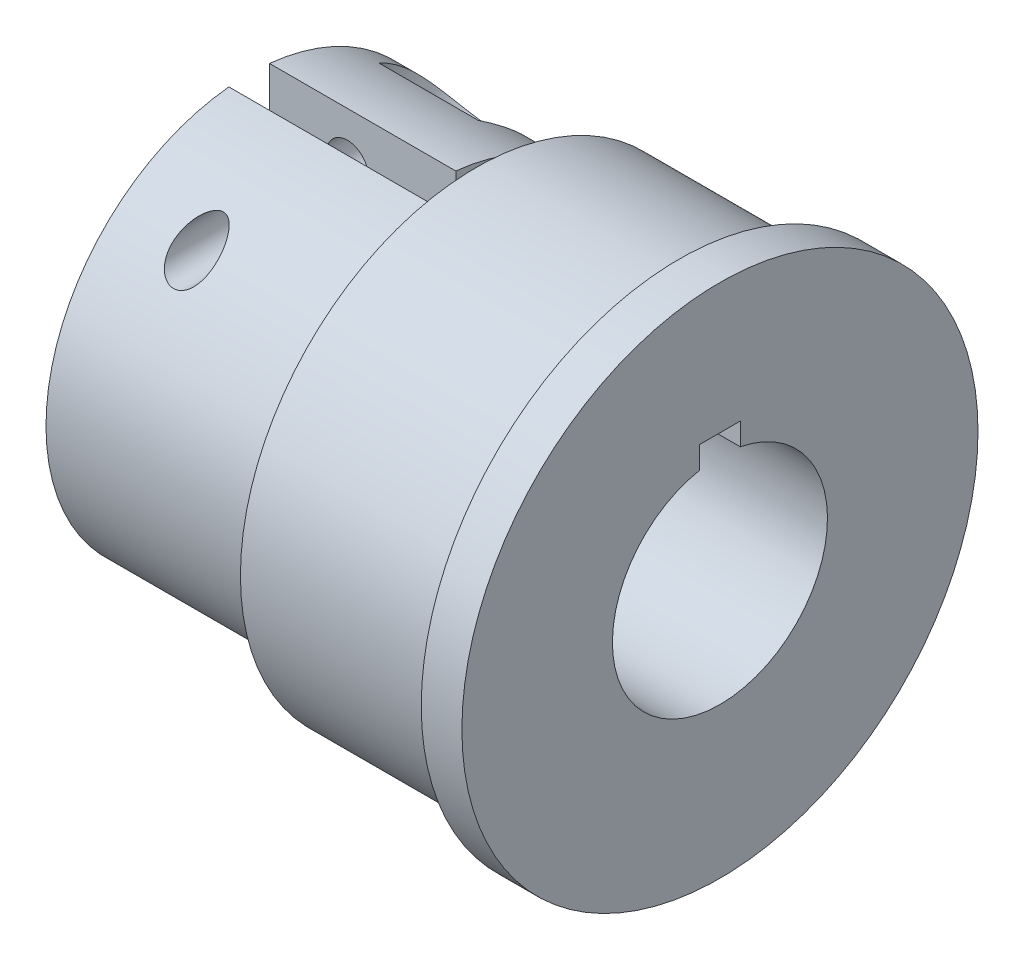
ISO-10303-21;
HEADER;
FILE_DESCRIPTION(('STEP AP214'),'2;1');
FILE_NAME('part.step','',(''),(''),'','','');
FILE_SCHEMA(('AUTOMOTIVE_DESIGN { 1 0 10303 214 1 1 1 1 }'));
ENDSEC;
DATA;
#1=APPLICATION_CONTEXT('core data for automotive mechanical design processes');
#2=APPLICATION_PROTOCOL_DEFINITION('international standard','automotive_design',2000,#1);
#3=PRODUCT_CONTEXT('',#1,'mechanical');
#4=PRODUCT('Part','Part','',(#3));
#5=PRODUCT_RELATED_PRODUCT_CATEGORY('part','',(#4));
#6=PRODUCT_DEFINITION_FORMATION('','',#4);
#7=PRODUCT_DEFINITION_CONTEXT('part definition',#1,'design');
#8=PRODUCT_DEFINITION('design','',#6,#7);
#9=PRODUCT_DEFINITION_SHAPE('','',#8);
#10=(LENGTH_UNIT() NAMED_UNIT(*) SI_UNIT(.MILLI.,.METRE.));
#11=(NAMED_UNIT(*) PLANE_ANGLE_UNIT() SI_UNIT($,.RADIAN.));
#12=(NAMED_UNIT(*) SI_UNIT($,.STERADIAN.) SOLID_ANGLE_UNIT());
#13=UNCERTAINTY_MEASURE_WITH_UNIT(LENGTH_MEASURE(1.E-05),#10,'distance_accuracy_value','');
#14=(GEOMETRIC_REPRESENTATION_CONTEXT(3) GLOBAL_UNCERTAINTY_ASSIGNED_CONTEXT((#13)) GLOBAL_UNIT_ASSIGNED_CONTEXT((#10,
#11,#12)) REPRESENTATION_CONTEXT('',''));
#15=CARTESIAN_POINT('',(0.,0.,0.));
#16=DIRECTION('',(0.,0.,1.));
#17=DIRECTION('',(1.,0.,0.));
#18=AXIS2_PLACEMENT_3D('',#15,#16,#17);
#19=CARTESIAN_POINT('',(-30.,0.,0.));
#20=DIRECTION('',(1.,0.,0.));
#21=DIRECTION('',(0.,0.,-1.));
#22=AXIS2_PLACEMENT_3D('',#19,#20,#21);
#23=CYLINDRICAL_SURFACE('',#22,15.);
#24=CARTESIAN_POINT('',(-9.32416043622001,14.9916643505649,0.5));
#25=CARTESIAN_POINT('',(-9.33032237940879,14.9945038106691,0.414885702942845));
#26=CARTESIAN_POINT('',(-9.33494133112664,14.9966202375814,0.329641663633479));
#27=CARTESIAN_POINT('',(-9.34102292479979,14.9993996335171,0.159021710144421));
#28=CARTESIAN_POINT('',(-9.3424857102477,15.0000626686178,0.0736458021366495));
#29=CARTESIAN_POINT('',(-9.34203562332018,14.9998611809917,-0.18212944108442));
#30=CARTESIAN_POINT('',(-9.33531162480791,14.9968184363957,-0.352546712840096));
#31=CARTESIAN_POINT('',(-9.30986999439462,14.9850609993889,-0.690002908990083));
#32=CARTESIAN_POINT('',(-9.29130961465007,14.9764206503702,-0.857056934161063));
#33=CARTESIAN_POINT('',(-9.24401949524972,14.9536991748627,-1.18938565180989));
#34=CARTESIAN_POINT('',(-9.21528489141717,14.9396154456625,-1.35465945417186));
#35=CARTESIAN_POINT('',(-9.11564784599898,14.8887770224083,-1.85417969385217));
#36=CARTESIAN_POINT('',(-9.03200866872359,14.8436919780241,-2.1850160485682));
#37=CARTESIAN_POINT('',(-8.84738202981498,14.7327541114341,-2.83831325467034));
#38=CARTESIAN_POINT('',(-8.74637190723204,14.6668740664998,-3.16076252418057));
#39=CARTESIAN_POINT('',(-8.53683209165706,14.5139829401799,-3.8018226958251));
#40=CARTESIAN_POINT('',(-8.42823774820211,14.4267687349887,-4.12036379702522));
#41=CARTESIAN_POINT('',(-8.21189338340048,14.2315291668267,-4.75104879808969));
#42=CARTESIAN_POINT('',(-8.10414287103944,14.1235170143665,-5.06319662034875));
#43=CARTESIAN_POINT('',(-7.89872166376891,13.8905254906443,-5.67056150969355));
#44=CARTESIAN_POINT('',(-7.80082879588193,13.7662859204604,-5.96598594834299));
#45=CARTESIAN_POINT('',(-7.6154025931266,13.4976710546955,-6.55106841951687));
#46=CARTESIAN_POINT('',(-7.52787257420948,13.3532893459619,-6.8407245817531));
#47=CARTESIAN_POINT('',(-7.36817513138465,13.0448412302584,-7.41194900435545));
#48=CARTESIAN_POINT('',(-7.29593802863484,12.8808696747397,-7.69354866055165));
#49=CARTESIAN_POINT('',(-7.1714195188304,12.5327294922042,-8.24850194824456));
#50=CARTESIAN_POINT('',(-7.11912415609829,12.3485751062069,-8.52186122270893));
#51=CARTESIAN_POINT('',(-7.05705175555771,12.0424677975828,-8.94514790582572));
#52=CARTESIAN_POINT('',(-7.03864406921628,11.927009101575,-9.09854213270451));
#53=CARTESIAN_POINT('',(-7.01186626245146,11.6898417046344,-9.4013053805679));
#54=CARTESIAN_POINT('',(-7.00349342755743,11.5681347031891,-9.55067547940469));
#55=CARTESIAN_POINT('',(-6.99826662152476,11.3189585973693,-9.84470954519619));
#56=CARTESIAN_POINT('',(-7.00140994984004,11.1914908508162,-9.98937460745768));
#57=CARTESIAN_POINT('',(-7.02084281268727,10.9315206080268,-10.2732107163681));
#58=CARTESIAN_POINT('',(-7.03712956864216,10.7990191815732,-10.4123829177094));
#59=CARTESIAN_POINT('',(-7.07972274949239,10.5576398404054,-10.6564243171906));
#60=CARTESIAN_POINT('',(-7.10329459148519,10.4494803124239,-10.7624822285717));
#61=CARTESIAN_POINT('',(-7.16074119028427,10.2314636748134,-10.9699487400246));
#62=CARTESIAN_POINT('',(-7.19461341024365,10.1216069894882,-11.0713584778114));
#63=CARTESIAN_POINT('',(-7.27349650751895,9.90127287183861,-11.2688358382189));
#64=CARTESIAN_POINT('',(-7.3184964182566,9.79079615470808,-11.3649086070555));
#65=CARTESIAN_POINT('',(-7.42044511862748,9.57036567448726,-11.5511428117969));
#66=CARTESIAN_POINT('',(-7.47739113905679,9.46041179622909,-11.6413056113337));
#67=CARTESIAN_POINT('',(-7.59067218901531,9.26526624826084,-11.7969071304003));
#68=CARTESIAN_POINT('',(-7.64465836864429,9.17969221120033,-11.8635808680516));
#69=CARTESIAN_POINT('',(-7.76072217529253,9.01069204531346,-11.9924439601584));
#70=CARTESIAN_POINT('',(-7.82279806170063,8.92726545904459,-12.0546342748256));
#71=CARTESIAN_POINT('',(-7.95515745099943,8.7634904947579,-12.1742153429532));
#72=CARTESIAN_POINT('',(-8.02544244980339,8.68314268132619,-12.2316052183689));
#73=CARTESIAN_POINT('',(-8.17412351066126,8.52661408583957,-12.3412308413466));
#74=CARTESIAN_POINT('',(-8.2525155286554,8.45043125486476,-12.3934691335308));
#75=CARTESIAN_POINT('',(-8.4178592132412,8.30269698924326,-12.4929266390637));
#76=CARTESIAN_POINT('',(-8.50487265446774,8.231186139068,-12.5401037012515));
#77=CARTESIAN_POINT('',(-8.68648345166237,8.09459668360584,-12.6287026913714));
#78=CARTESIAN_POINT('',(-8.7810771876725,8.02951504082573,-12.670127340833));
#79=CARTESIAN_POINT('',(-8.97726210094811,7.90683283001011,-12.7470482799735));
#80=CARTESIAN_POINT('',(-9.07885251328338,7.84923144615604,-12.7825452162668));
#81=CARTESIAN_POINT('',(-9.28823614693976,7.74251029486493,-12.8474682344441));
#82=CARTESIAN_POINT('',(-9.39602848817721,7.69338932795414,-12.8768951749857));
#83=CARTESIAN_POINT('',(-9.60323810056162,7.60998528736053,-12.9263365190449));
#84=CARTESIAN_POINT('',(-9.70205161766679,7.57461983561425,-12.9470638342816));
#85=CARTESIAN_POINT('',(-9.90296217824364,7.51158236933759,-12.9837383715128));
#86=CARTESIAN_POINT('',(-10.0050588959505,7.48390959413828,-12.9996860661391));
#87=CARTESIAN_POINT('',(-10.211695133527,7.43666116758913,-13.026772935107));
#88=CARTESIAN_POINT('',(-10.3162337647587,7.41708261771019,-13.0379138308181));
#89=CARTESIAN_POINT('',(-10.5269330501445,7.38629146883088,-13.0553825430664));
#90=CARTESIAN_POINT('',(-10.6330936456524,7.37507856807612,-13.0617105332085));
#91=CARTESIAN_POINT('',(-10.8387220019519,7.36166397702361,-13.069275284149));
#92=CARTESIAN_POINT('',(-10.9381410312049,7.3588891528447,-13.0708358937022));
#93=CARTESIAN_POINT('',(-11.1369217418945,7.36075377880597,-13.0697859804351));
#94=CARTESIAN_POINT('',(-11.2362833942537,7.36539563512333,-13.0671741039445));
#95=CARTESIAN_POINT('',(-11.4341342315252,7.38203586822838,-13.0577807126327));
#96=CARTESIAN_POINT('',(-11.532623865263,7.39403020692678,-13.0510014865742));
#97=CARTESIAN_POINT('',(-11.7281104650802,7.42522582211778,-13.0332782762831));
#98=CARTESIAN_POINT('',(-11.8251068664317,7.44442975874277,-13.0223327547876));
#99=CARTESIAN_POINT('',(-12.0157232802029,7.48953212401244,-12.9964447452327));
#100=CARTESIAN_POINT('',(-12.1093700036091,7.51534633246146,-12.9815524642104));
#101=CARTESIAN_POINT('',(-12.2938938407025,7.57345802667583,-12.9477356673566));
#102=CARTESIAN_POINT('',(-12.3847699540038,7.60575782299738,-12.9288097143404));
#103=CARTESIAN_POINT('',(-12.6522809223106,7.71181650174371,-12.8660276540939));
#104=CARTESIAN_POINT('',(-12.823988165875,7.79478037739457,-12.8161418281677));
#105=CARTESIAN_POINT('',(-13.1549998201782,7.98421554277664,-12.6990163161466));
#106=CARTESIAN_POINT('',(-13.3137521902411,8.09133785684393,-12.6312850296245));
#107=CARTESIAN_POINT('',(-13.6099102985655,8.32259426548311,-12.4801233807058));
#108=CARTESIAN_POINT('',(-13.7473111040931,8.44673227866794,-12.3966894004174));
#109=CARTESIAN_POINT('',(-14.0100107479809,8.71796715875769,-12.2076448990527));
#110=CARTESIAN_POINT('',(-14.1332871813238,8.8661186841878,-12.1007519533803));
#111=CARTESIAN_POINT('',(-14.3529805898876,9.17040256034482,-11.871813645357));
#112=CARTESIAN_POINT('',(-14.4493824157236,9.32653935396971,-11.7497597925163));
#113=CARTESIAN_POINT('',(-14.5940709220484,9.59906501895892,-11.5273627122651));
#114=CARTESIAN_POINT('',(-14.6483230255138,9.71482662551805,-11.4300323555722));
#115=CARTESIAN_POINT('',(-14.744085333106,9.94631132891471,-11.2291744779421));
#116=CARTESIAN_POINT('',(-14.7855909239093,10.0620343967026,-11.1256447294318));
#117=CARTESIAN_POINT('',(-14.8568465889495,10.2922724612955,-10.9130075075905));
#118=CARTESIAN_POINT('',(-14.8865781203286,10.4067852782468,-10.803891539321));
#119=CARTESIAN_POINT('',(-14.935235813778,10.6334501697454,-10.5808809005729));
#120=CARTESIAN_POINT('',(-14.9541587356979,10.7456015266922,-10.4669848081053));
#121=CARTESIAN_POINT('',(-14.9883320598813,11.0149392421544,-10.1844970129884));
#122=CARTESIAN_POINT('',(-14.9983942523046,11.1704679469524,-10.0136867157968));
#123=CARTESIAN_POINT('',(-15.0012513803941,11.4735249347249,-9.66497143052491));
#124=CARTESIAN_POINT('',(-14.9940386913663,11.6210496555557,-9.48706334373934));
#125=CARTESIAN_POINT('',(-14.9649465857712,11.9072858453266,-9.12522906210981));
#126=CARTESIAN_POINT('',(-14.9430534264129,12.0459889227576,-8.94129738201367));
#127=CARTESIAN_POINT('',(-14.8869140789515,12.3139141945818,-8.56856041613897));
#128=CARTESIAN_POINT('',(-14.8526683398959,12.4431367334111,-8.37975530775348));
#129=CARTESIAN_POINT('',(-14.750997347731,12.7641306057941,-7.88711693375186));
#130=CARTESIAN_POINT('',(-14.6758518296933,12.9486620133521,-7.58013824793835));
#131=CARTESIAN_POINT('',(-14.5067460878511,13.293452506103,-6.95779233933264));
#132=CARTESIAN_POINT('',(-14.4127737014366,13.4536957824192,-6.64241980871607));
#133=CARTESIAN_POINT('',(-14.2116559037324,13.7507853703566,-6.00337819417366));
#134=CARTESIAN_POINT('',(-14.1044602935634,13.8875374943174,-5.67968143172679));
#135=CARTESIAN_POINT('',(-13.8831013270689,14.1373263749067,-5.02578469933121));
#136=CARTESIAN_POINT('',(-13.7689405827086,14.2503719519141,-4.6955871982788));
#137=CARTESIAN_POINT('',(-13.5677767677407,14.4288504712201,-4.10834482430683));
#138=CARTESIAN_POINT('',(-13.4808305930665,14.4991992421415,-3.85275985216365));
#139=CARTESIAN_POINT('',(-13.3105696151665,14.6265323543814,-3.33693826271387));
#140=CARTESIAN_POINT('',(-13.2272561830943,14.6835116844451,-3.07669994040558));
#141=CARTESIAN_POINT('',(-13.0702424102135,14.783482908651,-2.55324096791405));
#142=CARTESIAN_POINT('',(-12.9964634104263,14.8265943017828,-2.29006719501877));
#143=CARTESIAN_POINT('',(-12.8650136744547,14.8990503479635,-1.75790149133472));
#144=CARTESIAN_POINT('',(-12.8073260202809,14.9284094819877,-1.4889159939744));
#145=CARTESIAN_POINT('',(-12.7389529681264,14.9619675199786,-1.07675585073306));
#146=CARTESIAN_POINT('',(-12.7190218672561,14.9714702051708,-0.93554273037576));
#147=CARTESIAN_POINT('',(-12.6870899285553,14.9864946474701,-0.652015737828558));
#148=CARTESIAN_POINT('',(-12.6750874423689,14.9920172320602,-0.509702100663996));
#149=CARTESIAN_POINT('',(-12.6597924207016,14.9990392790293,-0.222781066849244));
#150=CARTESIAN_POINT('',(-12.6566064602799,15.0004895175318,-0.0781666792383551));
#151=CARTESIAN_POINT('',(-12.6593491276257,14.9992159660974,0.211099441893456));
#152=CARTESIAN_POINT('',(-12.6652867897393,14.9964880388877,0.355751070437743));
#153=CARTESIAN_POINT('',(-12.67583956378,14.9916643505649,0.5));
#154=B_SPLINE_CURVE_WITH_KNOTS('',3,(#24,#25,#26,#27,#28,#29,#30,#31,#32,#33,#34,#35,#36,#37,
#38,#39,#40,#41,#42,#43,#44,#45,#46,#47,#48,#49,#50,#51,#52,#53,#54,#55,#56,#57,#58,#59,#60,#61,
#62,#63,#64,#65,#66,#67,#68,#69,#70,#71,#72,#73,#74,#75,#76,#77,#78,#79,#80,#81,#82,#83,#84,#85,
#86,#87,#88,#89,#90,#91,#92,#93,#94,#95,#96,#97,#98,#99,#100,#101,#102,#103,#104,#105,#106,#107,
#108,#109,#110,#111,#112,#113,#114,#115,#116,#117,#118,#119,#120,#121,#122,#123,#124,#125,#126,
#127,#128,#129,#130,#131,#132,#133,#134,#135,#136,#137,#138,#139,#140,#141,#142,#143,#144,#145,
#146,#147,#148,#149,#150,#151,#152,#153),.UNSPECIFIED.,.F.,.F.,(4,2,2,2,2,2,2,2,2,2,2,2,2,2,2,2,
2,2,2,2,2,2,2,2,2,2,2,2,2,2,2,2,2,2,2,2,2,2,2,2,2,2,2,2,2,2,2,2,2,2,2,2,2,2,2,2,2,2,2,2,2,2,2,2,
4),(0.,0.256122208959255,0.512232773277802,1.02334248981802,1.52779943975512,2.03249789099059,
3.06318192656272,4.0952208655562,5.137496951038,6.17911317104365,7.18369526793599,
8.18859795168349,9.18881848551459,10.1883377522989,10.7666148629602,11.3447355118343,
11.9227205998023,12.5005835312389,12.9601195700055,13.4195425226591,13.8785144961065,
14.3373801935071,14.7005591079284,15.0636600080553,15.4268271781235,15.7898140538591,
16.1556212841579,16.5212548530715,16.8868485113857,17.2523904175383,17.5729083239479,
17.8933945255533,18.2137658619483,18.5341256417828,18.8321767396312,19.1303245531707,
19.4283087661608,19.7264030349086,20.0208734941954,20.3154490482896,20.9040167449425,
21.5108949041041,22.117913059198,22.7765451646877,23.4355477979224,23.9169629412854,
24.3985521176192,24.8808967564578,25.3633859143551,26.055996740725,26.7489133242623,
27.4424794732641,28.1360204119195,29.2321940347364,30.3290781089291,31.4302623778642,
32.5310362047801,33.3676610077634,34.2045989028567,35.0341187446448,35.862763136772,
36.2913157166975,36.7197791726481,37.1533997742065,37.5874500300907),.UNSPECIFIED.);
#155=CARTESIAN_POINT('',(-7.34750753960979,12.9903810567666,-7.5));
#156=VERTEX_POINT('',#155);
#157=CARTESIAN_POINT('',(-14.6524924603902,12.9903810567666,-7.5));
#158=VERTEX_POINT('',#157);
#159=EDGE_CURVE('E43',#156,#158,#154,.T.);
#160=ORIENTED_EDGE('',*,*,#159,.F.);
#161=DIRECTION('',(1.,0.,0.));
#162=VECTOR('',#161,1.);
#163=CARTESIAN_POINT('',(-30.,12.9903810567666,-7.5));
#164=LINE('',#163,#162);
#165=EDGE_CURVE('E195',#158,#156,#164,.T.);
#166=ORIENTED_EDGE('',*,*,#165,.F.);
#167=EDGE_LOOP('',(#160,#166));
#168=FACE_BOUND('',#167,.T.);
#169=CARTESIAN_POINT('',(-9.46653771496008,11.3596453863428,9.79583874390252));
#170=CARTESIAN_POINT('',(-9.46654209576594,11.3020112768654,9.86267479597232));
#171=CARTESIAN_POINT('',(-9.46978458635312,11.2437937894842,9.92898814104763));
#172=CARTESIAN_POINT('',(-9.48320493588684,11.1265650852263,10.0601850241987));
#173=CARTESIAN_POINT('',(-9.49338418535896,11.0675537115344,10.1250682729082));
#174=CARTESIAN_POINT('',(-9.53512190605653,10.8902193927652,10.3166394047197));
#175=CARTESIAN_POINT('',(-9.57787302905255,10.77120429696,10.4407025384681));
#176=CARTESIAN_POINT('',(-9.67477232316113,10.5840034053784,10.6296347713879));
#177=CARTESIAN_POINT('',(-9.71787547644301,10.514188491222,10.6986370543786));
#178=CARTESIAN_POINT('',(-9.81833215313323,10.3786977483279,10.8301182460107));
#179=CARTESIAN_POINT('',(-9.87566701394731,10.3130166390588,10.8926055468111));
#180=CARTESIAN_POINT('',(-9.99273885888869,10.2011348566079,10.9973429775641));
#181=CARTESIAN_POINT('',(-10.0498194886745,10.1536349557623,11.0411619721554));
#182=CARTESIAN_POINT('',(-10.1737320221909,10.065604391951,11.1214723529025));
#183=CARTESIAN_POINT('',(-10.2405527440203,10.0250658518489,11.1579720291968));
#184=CARTESIAN_POINT('',(-10.3709309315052,9.95958921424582,11.2164245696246));
#185=CARTESIAN_POINT('',(-10.4331040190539,9.93316986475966,11.2397964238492));
#186=CARTESIAN_POINT('',(-10.5624749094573,9.88833474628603,11.2792611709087));
#187=CARTESIAN_POINT('',(-10.629670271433,9.86991511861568,11.2953575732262));
#188=CARTESIAN_POINT('',(-10.767696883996,9.8422407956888,11.31948068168));
#189=CARTESIAN_POINT('',(-10.8385438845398,9.83303003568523,11.3274687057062));
#190=CARTESIAN_POINT('',(-10.9812728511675,9.82463366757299,11.3347522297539));
#191=CARTESIAN_POINT('',(-11.0531545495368,9.82544551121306,11.3340499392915));
#192=CARTESIAN_POINT('',(-11.1896470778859,9.83654148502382,11.3244202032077));
#193=CARTESIAN_POINT('',(-11.2543723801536,9.84604683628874,11.3161689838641));
#194=CARTESIAN_POINT('',(-11.3808856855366,9.87283171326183,11.2928077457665));
#195=CARTESIAN_POINT('',(-11.4426736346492,9.89011138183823,11.2776976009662));
#196=CARTESIAN_POINT('',(-11.5638739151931,9.93213045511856,11.2407110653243));
#197=CARTESIAN_POINT('',(-11.6231475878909,9.95709024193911,11.2186342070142));
#198=CARTESIAN_POINT('',(-11.7361985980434,10.0129816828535,11.1687780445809));
#199=CARTESIAN_POINT('',(-11.7899730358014,10.0439164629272,11.1409957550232));
#200=CARTESIAN_POINT('',(-11.9130749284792,10.1246269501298,11.0677907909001));
#201=CARTESIAN_POINT('',(-11.9793392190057,10.176832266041,11.0198812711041));
#202=CARTESIAN_POINT('',(-12.0995272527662,10.2876102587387,10.9165403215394));
#203=CARTESIAN_POINT('',(-12.1534262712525,10.3461953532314,10.8610941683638));
#204=CARTESIAN_POINT('',(-12.2668341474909,10.4891765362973,10.7233483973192));
#205=CARTESIAN_POINT('',(-12.3212811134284,10.5752242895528,10.6386054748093));
#206=CARTESIAN_POINT('',(-12.4104932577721,10.7499950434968,10.461987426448));
#207=CARTESIAN_POINT('',(-12.44522902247,10.8387218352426,10.3701018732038));
#208=CARTESIAN_POINT('',(-12.507476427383,11.0505978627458,10.1447734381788));
#209=CARTESIAN_POINT('',(-12.5269352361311,11.1737249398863,10.009057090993));
#210=CARTESIAN_POINT('',(-12.5346462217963,11.3548171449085,9.80187183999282));
#211=CARTESIAN_POINT('',(-12.5336211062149,11.414659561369,9.73211199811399));
#212=CARTESIAN_POINT('',(-12.5248007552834,11.5328461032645,9.59175883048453));
#213=CARTESIAN_POINT('',(-12.5170080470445,11.5911907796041,9.52116582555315));
#214=CARTESIAN_POINT('',(-12.4946682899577,11.7076122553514,9.37766439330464));
#215=CARTESIAN_POINT('',(-12.4799471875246,11.7656406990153,9.30474430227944));
#216=CARTESIAN_POINT('',(-12.4438796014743,11.8795351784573,9.15888637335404));
#217=CARTESIAN_POINT('',(-12.4225350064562,11.9354018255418,9.08594854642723));
#218=CARTESIAN_POINT('',(-12.373261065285,12.0446627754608,8.94060136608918));
#219=CARTESIAN_POINT('',(-12.345340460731,12.0980602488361,8.86819144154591));
#220=CARTESIAN_POINT('',(-12.2827217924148,12.2021527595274,8.72441063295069));
#221=CARTESIAN_POINT('',(-12.2480267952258,12.2528490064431,8.65303929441));
#222=CARTESIAN_POINT('',(-12.1645295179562,12.3600433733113,8.49938804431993));
#223=CARTESIAN_POINT('',(-12.1143125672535,12.4159472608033,8.41745228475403));
#224=CARTESIAN_POINT('',(-12.0025189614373,12.522589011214,8.25796101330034));
#225=CARTESIAN_POINT('',(-11.9409489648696,12.5733298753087,8.18040296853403));
#226=CARTESIAN_POINT('',(-11.8227125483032,12.6551496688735,8.0530303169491));
#227=CARTESIAN_POINT('',(-11.7691835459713,12.6878456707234,8.00136550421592));
#228=CARTESIAN_POINT('',(-11.6538223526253,12.7482595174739,7.9047513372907));
#229=CARTESIAN_POINT('',(-11.5920081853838,12.775987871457,7.85978784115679));
#230=CARTESIAN_POINT('',(-11.4820488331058,12.8161093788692,7.79411883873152));
#231=CARTESIAN_POINT('',(-11.4364666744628,12.8305029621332,7.77037798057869));
#232=CARTESIAN_POINT('',(-11.3415500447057,12.8553879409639,7.72913841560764));
#233=CARTESIAN_POINT('',(-11.2922216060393,12.8658854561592,7.71162992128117));
#234=CARTESIAN_POINT('',(-11.198068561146,12.8808958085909,7.68652771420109));
#235=CARTESIAN_POINT('',(-11.1536391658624,12.8860590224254,7.67785903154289));
#236=CARTESIAN_POINT('',(-11.0637111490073,12.8924449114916,7.66713151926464));
#237=CARTESIAN_POINT('',(-11.0182132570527,12.8936702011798,7.66506830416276));
#238=CARTESIAN_POINT('',(-10.9274877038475,12.8920644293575,7.66776866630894));
#239=CARTESIAN_POINT('',(-10.8822601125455,12.8892323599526,7.67253393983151));
#240=CARTESIAN_POINT('',(-10.7933406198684,12.8797783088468,7.68839341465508));
#241=CARTESIAN_POINT('',(-10.7496500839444,12.8731530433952,7.69949309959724));
#242=CARTESIAN_POINT('',(-10.6508778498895,12.8539370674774,7.73154246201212));
#243=CARTESIAN_POINT('',(-10.5967021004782,12.8401080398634,7.75451993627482));
#244=CARTESIAN_POINT('',(-10.4933161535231,12.8079981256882,7.80744170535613));
#245=CARTESIAN_POINT('',(-10.4441174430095,12.7897072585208,7.83740161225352));
#246=CARTESIAN_POINT('',(-10.3225207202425,12.7377482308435,7.92170713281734));
#247=CARTESIAN_POINT('',(-10.2539443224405,12.7014438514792,7.97988902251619));
#248=CARTESIAN_POINT('',(-10.1275766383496,12.6229480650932,8.10349290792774));
#249=CARTESIAN_POINT('',(-10.0698157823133,12.5807406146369,8.16893453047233));
#250=CARTESIAN_POINT('',(-9.97034972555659,12.4976087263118,8.29546639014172));
#251=CARTESIAN_POINT('',(-9.92753601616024,12.4572096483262,8.35604393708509));
#252=CARTESIAN_POINT('',(-9.84816230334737,12.3735991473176,8.47936323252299));
#253=CARTESIAN_POINT('',(-9.81160679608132,12.3303857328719,8.54210649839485));
#254=CARTESIAN_POINT('',(-9.74424962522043,12.2415216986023,8.66897612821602));
#255=CARTESIAN_POINT('',(-9.71345062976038,12.1958699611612,8.7331031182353));
#256=CARTESIAN_POINT('',(-9.65732023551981,12.1024016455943,8.86218025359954));
#257=CARTESIAN_POINT('',(-9.63199086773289,12.0545842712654,8.9271306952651));
#258=CARTESIAN_POINT('',(-9.56262260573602,11.9053141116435,9.12641790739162));
#259=CARTESIAN_POINT('',(-9.52715596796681,11.8006593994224,9.26143461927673));
#260=CARTESIAN_POINT('',(-9.4791077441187,11.5846413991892,9.53025786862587));
#261=CARTESIAN_POINT('',(-9.46652907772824,11.4732772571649,9.66406424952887));
#262=CARTESIAN_POINT('',(-9.46653771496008,11.3596453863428,9.79583874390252));
#263=B_SPLINE_CURVE_WITH_KNOTS('',3,(#169,#170,#171,#172,#173,#174,#175,#176,#177,#178,#179,
#180,#181,#182,#183,#184,#185,#186,#187,#188,#189,#190,#191,#192,#193,#194,#195,#196,#197,#198,
#199,#200,#201,#202,#203,#204,#205,#206,#207,#208,#209,#210,#211,#212,#213,#214,#215,#216,#217,
#218,#219,#220,#221,#222,#223,#224,#225,#226,#227,#228,#229,#230,#231,#232,#233,#234,#235,#236,
#237,#238,#239,#240,#241,#242,#243,#244,#245,#246,#247,#248,#249,#250,#251,#252,#253,#254,#255,
#256,#257,#258,#259,#260,#261,#262),.UNSPECIFIED.,.T.,.F.,(4,2,2,2,2,2,2,2,2,2,2,2,2,2,2,2,2,2,
2,2,2,2,2,2,2,2,2,2,2,2,2,2,2,2,2,2,2,2,2,2,2,2,2,2,2,2,4),(0.,0.264638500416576,
0.5293300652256,1.05693410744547,1.377622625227,1.69789281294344,1.95560973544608,
2.21303308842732,2.42658860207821,2.64004099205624,2.85450696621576,3.06891841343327,
3.26582418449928,3.46273357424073,3.66592438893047,3.86922179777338,4.15865157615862,
4.44865513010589,4.8438957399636,5.2397246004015,5.78937359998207,6.0649406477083,
6.34040483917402,6.62319211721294,6.90589883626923,7.18823184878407,7.47043735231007,
7.80334930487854,8.13606662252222,8.37926867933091,8.62195000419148,8.78156831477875,
8.94093483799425,9.07701316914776,9.21300113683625,9.34902289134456,9.48516257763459,
9.66549368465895,9.84623193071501,10.1355625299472,10.425695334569,10.6787503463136,
10.9319864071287,11.185339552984,11.4387866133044,11.960483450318,12.4822468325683),.UNSPECIFIED.);
#264=CARTESIAN_POINT('',(-9.46653771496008,11.3596453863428,9.79583874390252));
#265=VERTEX_POINT('',#264);
#266=EDGE_CURVE('E187',#265,#265,#263,.T.);
#267=ORIENTED_EDGE('',*,*,#266,.T.);
#268=EDGE_LOOP('',(#267));
#269=FACE_BOUND('',#268,.T.);
#270=DIRECTION('',(1.,0.,0.));
#271=VECTOR('',#270,1.);
#272=CARTESIAN_POINT('',(-30.,14.9248115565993,1.5));
#273=LINE('',#272,#271);
#274=CARTESIAN_POINT('',(-16.7522866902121,14.9248115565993,1.5));
#275=VERTEX_POINT('',#274);
#276=CARTESIAN_POINT('',(0.,14.9248115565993,1.5));
#277=VERTEX_POINT('',#276);
#278=EDGE_CURVE('E161',#275,#277,#273,.T.);
#279=ORIENTED_EDGE('',*,*,#278,.F.);
#280=CARTESIAN_POINT('',(-16.7522866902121,0.,0.));
#281=DIRECTION('',(1.,0.,0.));
#282=DIRECTION('',(0.,0.,-1.));
#283=AXIS2_PLACEMENT_3D('',#280,#281,#282);
#284=CIRCLE('',#283,15.);
#285=CARTESIAN_POINT('',(-16.7522866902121,14.9248115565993,-1.5));
#286=VERTEX_POINT('',#285);
#287=EDGE_CURVE('E50',#275,#286,#284,.T.);
#288=ORIENTED_EDGE('',*,*,#287,.T.);
#289=DIRECTION('',(1.,0.,0.));
#290=VECTOR('',#289,1.);
#291=CARTESIAN_POINT('',(-30.,14.9248115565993,-1.5));
#292=LINE('',#291,#290);
#293=CARTESIAN_POINT('',(-3.00000000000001,14.9248115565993,-1.5));
#294=VERTEX_POINT('',#293);
#295=EDGE_CURVE('E163',#286,#294,#292,.T.);
#296=ORIENTED_EDGE('',*,*,#295,.T.);
#297=CARTESIAN_POINT('',(-3.00000000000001,0.,0.));
#298=DIRECTION('',(-1.,0.,0.));
#299=DIRECTION('',(0.,0.,1.));
#300=AXIS2_PLACEMENT_3D('',#297,#298,#299);
#301=CIRCLE('',#300,15.);
#302=CARTESIAN_POINT('',(-3.00000000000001,-15.,0.));
#303=VERTEX_POINT('',#302);
#304=EDGE_CURVE('E184',#294,#303,#301,.T.);
#305=ORIENTED_EDGE('',*,*,#304,.T.);
#306=DIRECTION('',(1.,0.,0.));
#307=VECTOR('',#306,1.);
#308=CARTESIAN_POINT('',(-30.,-15.,0.));
#309=LINE('',#308,#307);
#310=CARTESIAN_POINT('',(0.,-15.,0.));
#311=VERTEX_POINT('',#310);
#312=EDGE_CURVE('E152',#311,#303,#309,.F.);
#313=ORIENTED_EDGE('',*,*,#312,.F.);
#314=CARTESIAN_POINT('',(0.,0.,0.));
#315=DIRECTION('',(-1.,0.,0.));
#316=DIRECTION('',(0.,0.,1.));
#317=AXIS2_PLACEMENT_3D('',#314,#315,#316);
#318=CIRCLE('',#317,15.);
#319=EDGE_CURVE('E162',#311,#277,#318,.T.);
#320=ORIENTED_EDGE('',*,*,#319,.T.);
#321=EDGE_LOOP('',(#279,#288,#296,#305,#313,#320));
#322=FACE_BOUND('',#321,.T.);
#323=ADVANCED_FACE('F35',(#168,#269,#322),#23,.T.);
#324=CARTESIAN_POINT('',(-11.,11.3596453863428,-19.05));
#325=DIRECTION('',(0.,0.,1.));
#326=DIRECTION('',(1.,0.,0.));
#327=AXIS2_PLACEMENT_3D('',#324,#325,#326);
#328=CYLINDRICAL_SURFACE('',#327,1.53346228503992);
#329=CARTESIAN_POINT('',(-11.,11.3596453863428,-1.5));
#330=DIRECTION('',(0.,0.,-1.));
#331=DIRECTION('',(-1.,0.,0.));
#332=AXIS2_PLACEMENT_3D('',#329,#330,#331);
#333=CIRCLE('',#332,1.53346228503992);
#334=CARTESIAN_POINT('',(-12.5334622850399,11.3596453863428,-1.5));
#335=VERTEX_POINT('',#334);
#336=EDGE_CURVE('E258',#335,#335,#333,.T.);
#337=ORIENTED_EDGE('',*,*,#336,.F.);
#338=EDGE_LOOP('',(#337));
#339=FACE_BOUND('',#338,.T.);
#340=CARTESIAN_POINT('',(-11.,11.3596453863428,-7.5));
#341=DIRECTION('',(0.,0.,-1.));
#342=DIRECTION('',(-1.,0.,0.));
#343=AXIS2_PLACEMENT_3D('',#340,#341,#342);
#344=CIRCLE('',#343,1.53346228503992);
#345=CARTESIAN_POINT('',(-12.5334622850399,11.3596453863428,-7.5));
#346=VERTEX_POINT('',#345);
#347=EDGE_CURVE('E196',#346,#346,#344,.F.);
#348=ORIENTED_EDGE('',*,*,#347,.F.);
#349=EDGE_LOOP('',(#348));
#350=FACE_BOUND('',#349,.T.);
#351=ADVANCED_FACE('F200',(#339,#350),#328,.F.);
#352=CARTESIAN_POINT('',(0.,6.4375,-1.5));
#353=DIRECTION('',(0.,0.,-1.));
#354=DIRECTION('',(-1.,0.,0.));
#355=AXIS2_PLACEMENT_3D('',#352,#353,#354);
#356=PLANE('',#355);
#357=DIRECTION('',(1.,0.,0.));
#358=VECTOR('',#357,1.);
#359=CARTESIAN_POINT('',(0.,9.4375,-1.5));
#360=LINE('',#359,#358);
#361=CARTESIAN_POINT('',(0.,9.4375,-1.5));
#362=VERTEX_POINT('',#361);
#363=CARTESIAN_POINT('',(18.,9.4375,-1.5));
#364=VERTEX_POINT('',#363);
#365=EDGE_CURVE('E132',#362,#364,#360,.T.);
#366=ORIENTED_EDGE('',*,*,#365,.F.);
#367=DIRECTION('',(0.,-1.,0.));
#368=VECTOR('',#367,1.);
#369=CARTESIAN_POINT('',(0.,6.4375,-1.5));
#370=LINE('',#369,#368);
#371=CARTESIAN_POINT('',(0.,7.79447921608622,-1.5));
#372=VERTEX_POINT('',#371);
#373=EDGE_CURVE('E241',#362,#372,#370,.T.);
#374=ORIENTED_EDGE('',*,*,#373,.T.);
#375=DIRECTION('',(-1.,0.,0.));
#376=VECTOR('',#375,1.);
#377=CARTESIAN_POINT('',(0.,7.79447921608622,-1.5));
#378=LINE('',#377,#376);
#379=CARTESIAN_POINT('',(18.,7.79447921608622,-1.5));
#380=VERTEX_POINT('',#379);
#381=EDGE_CURVE('E130',#380,#372,#378,.T.);
#382=ORIENTED_EDGE('',*,*,#381,.F.);
#383=DIRECTION('',(0.,1.,0.));
#384=VECTOR('',#383,1.);
#385=CARTESIAN_POINT('',(18.,6.4375,-1.5));
#386=LINE('',#385,#384);
#387=EDGE_CURVE('E165',#380,#364,#386,.T.);
#388=ORIENTED_EDGE('',*,*,#387,.T.);
#389=EDGE_LOOP('',(#366,#374,#382,#388));
#390=FACE_BOUND('',#389,.T.);
#391=ADVANCED_FACE('F205',(#390),#356,.F.);
#392=CARTESIAN_POINT('',(0.,0.,0.));
#393=DIRECTION('',(-1.,0.,0.));
#394=DIRECTION('',(0.,0.,1.));
#395=AXIS2_PLACEMENT_3D('',#392,#393,#394);
#396=CYLINDRICAL_SURFACE('',#395,7.9375);
#397=CARTESIAN_POINT('',(-3.00000000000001,7.79447921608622,-1.5));
#398=VERTEX_POINT('',#397);
#399=CARTESIAN_POINT('',(-16.7522866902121,7.79447921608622,-1.5));
#400=VERTEX_POINT('',#399);
#401=EDGE_CURVE('E122',#398,#400,#378,.T.);
#402=ORIENTED_EDGE('',*,*,#401,.T.);
#403=CARTESIAN_POINT('',(-16.7522866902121,0.,0.));
#404=DIRECTION('',(1.,0.,0.));
#405=DIRECTION('',(0.,0.,-1.));
#406=AXIS2_PLACEMENT_3D('',#403,#404,#405);
#407=CIRCLE('',#406,7.9375);
#408=CARTESIAN_POINT('',(-16.7522866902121,7.79447921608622,1.5));
#409=VERTEX_POINT('',#408);
#410=EDGE_CURVE('E110',#400,#409,#407,.F.);
#411=ORIENTED_EDGE('',*,*,#410,.T.);
#412=DIRECTION('',(-1.,0.,0.));
#413=VECTOR('',#412,1.);
#414=CARTESIAN_POINT('',(0.,7.79447921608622,1.5));
#415=LINE('',#414,#413);
#416=CARTESIAN_POINT('',(18.,7.79447921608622,1.5));
#417=VERTEX_POINT('',#416);
#418=EDGE_CURVE('E118',#409,#417,#415,.F.);
#419=ORIENTED_EDGE('',*,*,#418,.T.);
#420=CARTESIAN_POINT('',(18.,0.,0.));
#421=DIRECTION('',(-1.,0.,0.));
#422=DIRECTION('',(0.,0.,1.));
#423=AXIS2_PLACEMENT_3D('',#420,#421,#422);
#424=CIRCLE('',#423,7.9375);
#425=EDGE_CURVE('E150',#380,#417,#424,.T.);
#426=ORIENTED_EDGE('',*,*,#425,.F.);
#427=ORIENTED_EDGE('',*,*,#381,.T.);
#428=CARTESIAN_POINT('',(0.,0.,0.));
#429=DIRECTION('',(1.,0.,0.));
#430=DIRECTION('',(0.,0.,-1.));
#431=AXIS2_PLACEMENT_3D('',#428,#429,#430);
#432=CIRCLE('',#431,7.9375);
#433=CARTESIAN_POINT('',(0.,-7.9375,0.));
#434=VERTEX_POINT('',#433);
#435=EDGE_CURVE('E238',#372,#434,#432,.F.);
#436=ORIENTED_EDGE('',*,*,#435,.T.);
#437=DIRECTION('',(-1.,0.,0.));
#438=VECTOR('',#437,1.);
#439=CARTESIAN_POINT('',(0.,-7.9375,0.));
#440=LINE('',#439,#438);
#441=CARTESIAN_POINT('',(-3.00000000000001,-7.9375,0.));
#442=VERTEX_POINT('',#441);
#443=EDGE_CURVE('E251',#442,#434,#440,.F.);
#444=ORIENTED_EDGE('',*,*,#443,.F.);
#445=CARTESIAN_POINT('',(-3.00000000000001,0.,0.));
#446=DIRECTION('',(-1.,0.,0.));
#447=DIRECTION('',(0.,0.,1.));
#448=AXIS2_PLACEMENT_3D('',#445,#446,#447);
#449=CIRCLE('',#448,7.9375);
#450=EDGE_CURVE('E244',#442,#398,#449,.F.);
#451=ORIENTED_EDGE('',*,*,#450,.T.);
#452=EDGE_LOOP('',(#402,#411,#419,#426,#427,#436,#444,#451));
#453=FACE_BOUND('',#452,.T.);
#454=ADVANCED_FACE('F37',(#453),#396,.F.);
#455=CARTESIAN_POINT('',(18.,0.,0.));
#456=DIRECTION('',(-1.,0.,0.));
#457=DIRECTION('',(0.,0.,1.));
#458=AXIS2_PLACEMENT_3D('',#455,#456,#457);
#459=PLANE('',#458);
#460=CARTESIAN_POINT('',(18.,0.,0.));
#461=DIRECTION('',(-1.,0.,0.));
#462=DIRECTION('',(0.,0.,1.));
#463=AXIS2_PLACEMENT_3D('',#460,#461,#462);
#464=CIRCLE('',#463,19.05);
#465=CARTESIAN_POINT('',(18.,0.,19.05));
#466=VERTEX_POINT('',#465);
#467=EDGE_CURVE('E147',#466,#466,#464,.T.);
#468=ORIENTED_EDGE('',*,*,#467,.F.);
#469=EDGE_LOOP('',(#468));
#470=FACE_BOUND('',#469,.T.);
#471=DIRECTION('',(0.,0.,1.));
#472=VECTOR('',#471,1.);
#473=CARTESIAN_POINT('',(18.,9.4375,1.5));
#474=LINE('',#473,#472);
#475=CARTESIAN_POINT('',(18.,9.4375,1.5));
#476=VERTEX_POINT('',#475);
#477=EDGE_CURVE('E166',#364,#476,#474,.T.);
#478=ORIENTED_EDGE('',*,*,#477,.F.);
#479=ORIENTED_EDGE('',*,*,#387,.F.);
#480=ORIENTED_EDGE('',*,*,#425,.T.);
#481=DIRECTION('',(0.,-1.,0.));
#482=VECTOR('',#481,1.);
#483=CARTESIAN_POINT('',(18.,6.4375,1.5));
#484=LINE('',#483,#482);
#485=EDGE_CURVE('E126',#476,#417,#484,.T.);
#486=ORIENTED_EDGE('',*,*,#485,.F.);
#487=EDGE_LOOP('',(#478,#479,#480,#486));
#488=FACE_BOUND('',#487,.T.);
#489=ADVANCED_FACE('F277',(#470,#488),#459,.F.);
#490=CARTESIAN_POINT('',(0.,0.,0.));
#491=DIRECTION('',(-1.,0.,0.));
#492=DIRECTION('',(0.,0.,1.));
#493=AXIS2_PLACEMENT_3D('',#490,#491,#492);
#494=CYLINDRICAL_SURFACE('',#493,19.05);
#495=CARTESIAN_POINT('',(15.,0.,0.));
#496=DIRECTION('',(-1.,0.,0.));
#497=DIRECTION('',(0.,0.,1.));
#498=AXIS2_PLACEMENT_3D('',#495,#496,#497);
#499=CIRCLE('',#498,19.05);
#500=CARTESIAN_POINT('',(15.,0.,19.05));
#501=VERTEX_POINT('',#500);
#502=EDGE_CURVE('E144',#501,#501,#499,.T.);
#503=ORIENTED_EDGE('',*,*,#502,.F.);
#504=EDGE_LOOP('',(#503));
#505=FACE_BOUND('',#504,.T.);
#506=ORIENTED_EDGE('',*,*,#467,.T.);
#507=EDGE_LOOP('',(#506));
#508=FACE_BOUND('',#507,.T.);
#509=ADVANCED_FACE('F279',(#505,#508),#494,.T.);
#510=CARTESIAN_POINT('',(15.,0.,0.));
#511=DIRECTION('',(-1.,0.,0.));
#512=DIRECTION('',(0.,0.,1.));
#513=AXIS2_PLACEMENT_3D('',#510,#511,#512);
#514=PLANE('',#513);
#515=ORIENTED_EDGE('',*,*,#502,.T.);
#516=EDGE_LOOP('',(#515));
#517=FACE_BOUND('',#516,.T.);
#518=CARTESIAN_POINT('',(15.,0.,0.));
#519=DIRECTION('',(-1.,0.,0.));
#520=DIRECTION('',(0.,0.,1.));
#521=AXIS2_PLACEMENT_3D('',#518,#519,#520);
#522=CIRCLE('',#521,17.399);
#523=CARTESIAN_POINT('',(15.,0.,17.399));
#524=VERTEX_POINT('',#523);
#525=EDGE_CURVE('E141',#524,#524,#522,.T.);
#526=ORIENTED_EDGE('',*,*,#525,.F.);
#527=EDGE_LOOP('',(#526));
#528=FACE_BOUND('',#527,.T.);
#529=ADVANCED_FACE('F285',(#517,#528),#514,.T.);
#530=CARTESIAN_POINT('',(0.,0.,0.));
#531=DIRECTION('',(-1.,0.,0.));
#532=DIRECTION('',(0.,0.,1.));
#533=AXIS2_PLACEMENT_3D('',#530,#531,#532);
#534=CYLINDRICAL_SURFACE('',#533,17.399);
#535=CARTESIAN_POINT('',(0.,0.,0.));
#536=DIRECTION('',(-1.,0.,0.));
#537=DIRECTION('',(0.,0.,1.));
#538=AXIS2_PLACEMENT_3D('',#535,#536,#537);
#539=CIRCLE('',#538,17.399);
#540=CARTESIAN_POINT('',(0.,0.,17.399));
#541=VERTEX_POINT('',#540);
#542=EDGE_CURVE('E138',#541,#541,#539,.T.);
#543=ORIENTED_EDGE('',*,*,#542,.F.);
#544=EDGE_LOOP('',(#543));
#545=FACE_BOUND('',#544,.T.);
#546=ORIENTED_EDGE('',*,*,#525,.T.);
#547=EDGE_LOOP('',(#546));
#548=FACE_BOUND('',#547,.T.);
#549=ADVANCED_FACE('F292',(#545,#548),#534,.T.);
#550=CARTESIAN_POINT('',(0.,0.,0.));
#551=DIRECTION('',(1.,0.,0.));
#552=DIRECTION('',(0.,0.,-1.));
#553=AXIS2_PLACEMENT_3D('',#550,#551,#552);
#554=PLANE('',#553);
#555=ORIENTED_EDGE('',*,*,#542,.T.);
#556=EDGE_LOOP('',(#555));
#557=FACE_BOUND('',#556,.T.);
#558=ORIENTED_EDGE('',*,*,#319,.F.);
#559=DIRECTION('',(0.,1.,0.));
#560=VECTOR('',#559,1.);
#561=CARTESIAN_POINT('',(0.,-16.9675598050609,0.));
#562=LINE('',#561,#560);
#563=EDGE_CURVE('E255',#311,#434,#562,.T.);
#564=ORIENTED_EDGE('',*,*,#563,.T.);
#565=ORIENTED_EDGE('',*,*,#435,.F.);
#566=ORIENTED_EDGE('',*,*,#373,.F.);
#567=DIRECTION('',(0.,0.,1.));
#568=VECTOR('',#567,1.);
#569=CARTESIAN_POINT('',(0.,9.4375,1.5));
#570=LINE('',#569,#568);
#571=CARTESIAN_POINT('',(0.,9.4375,1.5));
#572=VERTEX_POINT('',#571);
#573=EDGE_CURVE('E172',#362,#572,#570,.T.);
#574=ORIENTED_EDGE('',*,*,#573,.T.);
#575=DIRECTION('',(0.,-1.,0.));
#576=VECTOR('',#575,1.);
#577=CARTESIAN_POINT('',(0.,0.,1.5));
#578=LINE('',#577,#576);
#579=EDGE_CURVE('E157',#277,#572,#578,.T.);
#580=ORIENTED_EDGE('',*,*,#579,.F.);
#581=EDGE_LOOP('',(#558,#564,#565,#566,#574,#580));
#582=FACE_BOUND('',#581,.T.);
#583=ADVANCED_FACE('F272',(#557,#582),#554,.F.);
#584=ORIENTED_EDGE('',*,*,#336,.T.);
#585=EDGE_LOOP('',(#584));
#586=FACE_BOUND('',#585,.T.);
#587=ORIENTED_EDGE('',*,*,#295,.F.);
#588=DIRECTION('',(0.,-1.,0.));
#589=VECTOR('',#588,1.);
#590=CARTESIAN_POINT('',(-16.7522866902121,6.4375,-1.5));
#591=LINE('',#590,#589);
#592=EDGE_CURVE('E265',#286,#400,#591,.T.);
#593=ORIENTED_EDGE('',*,*,#592,.T.);
#594=ORIENTED_EDGE('',*,*,#401,.F.);
#595=DIRECTION('',(0.,1.,0.));
#596=VECTOR('',#595,1.);
#597=CARTESIAN_POINT('',(-3.00000000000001,6.4375,-1.5));
#598=LINE('',#597,#596);
#599=EDGE_CURVE('E248',#398,#294,#598,.T.);
#600=ORIENTED_EDGE('',*,*,#599,.T.);
#601=EDGE_LOOP('',(#587,#593,#594,#600));
#602=FACE_BOUND('',#601,.T.);
#603=ADVANCED_FACE('F268',(#586,#602),#356,.F.);
#604=CARTESIAN_POINT('',(0.,6.4375,1.5));
#605=DIRECTION('',(0.,0.,1.));
#606=DIRECTION('',(1.,0.,0.));
#607=AXIS2_PLACEMENT_3D('',#604,#605,#606);
#608=PLANE('',#607);
#609=CARTESIAN_POINT('',(-11.,11.3596453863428,1.5));
#610=DIRECTION('',(0.,0.,1.));
#611=DIRECTION('',(1.,0.,0.));
#612=AXIS2_PLACEMENT_3D('',#609,#610,#611);
#613=CIRCLE('',#612,1.53346228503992);
#614=CARTESIAN_POINT('',(-9.46653771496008,11.3596453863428,1.5));
#615=VERTEX_POINT('',#614);
#616=EDGE_CURVE('E194',#615,#615,#613,.T.);
#617=ORIENTED_EDGE('',*,*,#616,.T.);
#618=EDGE_LOOP('',(#617));
#619=FACE_BOUND('',#618,.T.);
#620=ORIENTED_EDGE('',*,*,#418,.F.);
#621=DIRECTION('',(0.,1.,0.));
#622=VECTOR('',#621,1.);
#623=CARTESIAN_POINT('',(-16.7522866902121,6.4375,1.5));
#624=LINE('',#623,#622);
#625=EDGE_CURVE('E11',#409,#275,#624,.T.);
#626=ORIENTED_EDGE('',*,*,#625,.T.);
#627=ORIENTED_EDGE('',*,*,#278,.T.);
#628=ORIENTED_EDGE('',*,*,#579,.T.);
#629=DIRECTION('',(1.,0.,0.));
#630=VECTOR('',#629,1.);
#631=CARTESIAN_POINT('',(0.,9.4375,1.5));
#632=LINE('',#631,#630);
#633=EDGE_CURVE('E128',#572,#476,#632,.T.);
#634=ORIENTED_EDGE('',*,*,#633,.T.);
#635=ORIENTED_EDGE('',*,*,#485,.T.);
#636=EDGE_LOOP('',(#620,#626,#627,#628,#634,#635));
#637=FACE_BOUND('',#636,.T.);
#638=ADVANCED_FACE('F124',(#619,#637),#608,.F.);
#639=CARTESIAN_POINT('',(0.,9.4375,1.5));
#640=DIRECTION('',(0.,1.,0.));
#641=DIRECTION('',(0.,0.,1.));
#642=AXIS2_PLACEMENT_3D('',#639,#640,#641);
#643=PLANE('',#642);
#644=ORIENTED_EDGE('',*,*,#477,.T.);
#645=ORIENTED_EDGE('',*,*,#633,.F.);
#646=ORIENTED_EDGE('',*,*,#573,.F.);
#647=ORIENTED_EDGE('',*,*,#365,.T.);
#648=EDGE_LOOP('',(#644,#645,#646,#647));
#649=FACE_BOUND('',#648,.T.);
#650=ADVANCED_FACE('F216',(#649),#643,.F.);
#651=CARTESIAN_POINT('',(-3.00000000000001,-16.9675598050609,-30.));
#652=DIRECTION('',(-1.,0.,0.));
#653=DIRECTION('',(0.,0.,1.));
#654=AXIS2_PLACEMENT_3D('',#651,#652,#653);
#655=PLANE('',#654);
#656=DIRECTION('',(0.,-1.,0.));
#657=VECTOR('',#656,1.);
#658=CARTESIAN_POINT('',(-3.00000000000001,-16.9675598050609,0.));
#659=LINE('',#658,#657);
#660=EDGE_CURVE('E253',#442,#303,#659,.T.);
#661=ORIENTED_EDGE('',*,*,#660,.T.);
#662=ORIENTED_EDGE('',*,*,#304,.F.);
#663=ORIENTED_EDGE('',*,*,#599,.F.);
#664=ORIENTED_EDGE('',*,*,#450,.F.);
#665=EDGE_LOOP('',(#661,#662,#663,#664));
#666=FACE_BOUND('',#665,.T.);
#667=ADVANCED_FACE('F213',(#666),#655,.F.);
#668=CARTESIAN_POINT('',(0.,0.,0.));
#669=DIRECTION('',(0.,0.,-1.));
#670=DIRECTION('',(-1.,0.,0.));
#671=AXIS2_PLACEMENT_3D('',#668,#669,#670);
#672=PLANE('',#671);
#673=ORIENTED_EDGE('',*,*,#443,.T.);
#674=ORIENTED_EDGE('',*,*,#563,.F.);
#675=ORIENTED_EDGE('',*,*,#312,.T.);
#676=ORIENTED_EDGE('',*,*,#660,.F.);
#677=EDGE_LOOP('',(#673,#674,#675,#676));
#678=FACE_BOUND('',#677,.T.);
#679=ADVANCED_FACE('F211',(#678),#672,.T.);
#680=ORIENTED_EDGE('',*,*,#266,.F.);
#681=EDGE_LOOP('',(#680));
#682=FACE_BOUND('',#681,.T.);
#683=ORIENTED_EDGE('',*,*,#616,.F.);
#684=EDGE_LOOP('',(#683));
#685=FACE_BOUND('',#684,.T.);
#686=ADVANCED_FACE('F207',(#682,#685),#328,.F.);
#687=CARTESIAN_POINT('',(-11.,11.3596453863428,-19.05));
#688=DIRECTION('',(0.,0.,1.));
#689=DIRECTION('',(1.,0.,0.));
#690=AXIS2_PLACEMENT_3D('',#687,#688,#689);
#691=CYLINDRICAL_SURFACE('',#690,4.);
#692=ORIENTED_EDGE('',*,*,#159,.T.);
#693=CARTESIAN_POINT('',(-11.,11.3596453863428,-7.5));
#694=DIRECTION('',(0.,0.,-1.));
#695=DIRECTION('',(-1.,0.,0.));
#696=AXIS2_PLACEMENT_3D('',#693,#694,#695);
#697=CIRCLE('',#696,4.);
#698=EDGE_CURVE('E56',#156,#158,#697,.T.);
#699=ORIENTED_EDGE('',*,*,#698,.F.);
#700=EDGE_LOOP('',(#692,#699));
#701=FACE_BOUND('',#700,.T.);
#702=ADVANCED_FACE('F208',(#701),#691,.F.);
#703=CARTESIAN_POINT('',(-11.,11.3596453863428,-7.5));
#704=DIRECTION('',(0.,0.,-1.));
#705=DIRECTION('',(-1.,0.,0.));
#706=AXIS2_PLACEMENT_3D('',#703,#704,#705);
#707=PLANE('',#706);
#708=ORIENTED_EDGE('',*,*,#347,.T.);
#709=EDGE_LOOP('',(#708));
#710=FACE_BOUND('',#709,.T.);
#711=ORIENTED_EDGE('',*,*,#165,.T.);
#712=ORIENTED_EDGE('',*,*,#698,.T.);
#713=EDGE_LOOP('',(#711,#712));
#714=FACE_BOUND('',#713,.T.);
#715=ADVANCED_FACE('F313',(#710,#714),#707,.T.);
#716=CARTESIAN_POINT('',(-16.7522866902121,15.4563149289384,-19.05));
#717=DIRECTION('',(1.,0.,0.));
#718=DIRECTION('',(0.,0.,-1.));
#719=AXIS2_PLACEMENT_3D('',#716,#717,#718);
#720=PLANE('',#719);
#721=ORIENTED_EDGE('',*,*,#287,.F.);
#722=ORIENTED_EDGE('',*,*,#625,.F.);
#723=ORIENTED_EDGE('',*,*,#410,.F.);
#724=ORIENTED_EDGE('',*,*,#592,.F.);
#725=EDGE_LOOP('',(#721,#722,#723,#724));
#726=FACE_BOUND('',#725,.T.);
#727=ADVANCED_FACE('F109',(#726),#720,.F.);
#728=CLOSED_SHELL('',(#323,#351,#391,#454,#489,#509,#529,#549,#583,#603,#638,#650,#667,#679,
#686,#702,#715,#727));
#729=MANIFOLD_SOLID_BREP('B2',#728);
#730=ADVANCED_BREP_SHAPE_REPRESENTATION('',(#18,#729),#14);
#731=SHAPE_DEFINITION_REPRESENTATION(#9,#730);
ENDSEC;
END-ISO-10303-21;
